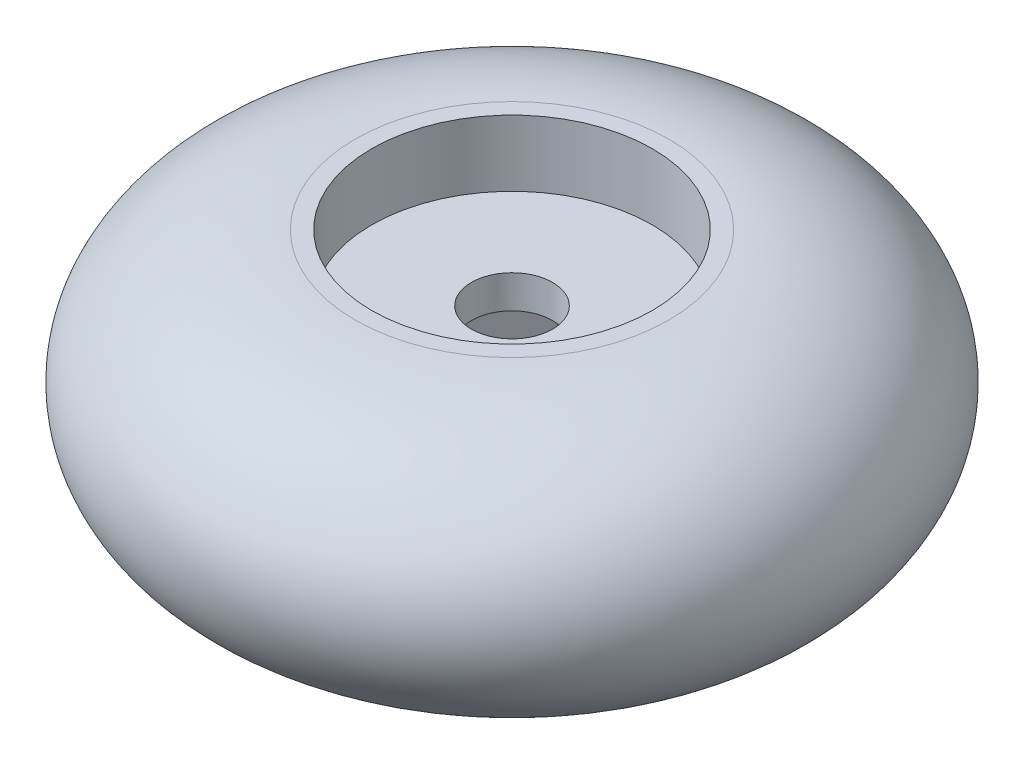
from build123d import *

# Parameters (mm, degrees)
SKETCH2_R                        = 8.5
CUT_EXTRUDE1_DEPTH               = 4
CUT_EXTRUDE2_DEPTH               = 10
F_10_0_1935_DIAMETER_HOLE1_D     = 4.9149
F_10_0_1935_DIAMETER_HOLE1_DEPTH = 5
F_10_0_1935_DIAMETER_HOLE1_TIP   = 1.476584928


with BuildPart() as part:
    # Sketch1 → Revolve1 (revolve)
    with BuildSketch(Plane.XY):
        with BuildLine():
            Line((9.5, 0), (0, 0))
            Line((0, 0), (0, -16))
            Line((0, -16), (9.5, -16))
            add(Edge.make_bspline(
                [(9.5, -16), (19.975475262, -16), (19.975475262, -8), (19.975475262, 0), (9.5, 0)],
                knots=[4.71238898, 4.71238898, 4.71238898, 6.283185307, 6.283185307, 7.853981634, 7.853981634, 7.853981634], degree=2, weights=[1, 0.707106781, 1, 0.707106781, 1]))
        make_face()
    revolve(axis=Axis((0, 0, 0), (0, -1, 0)))

    # Sketch2 → Cut-Extrude1 (cut)
    with BuildSketch(Plane(origin=(0, 0, 0), x_dir=(1, 0, 0), z_dir=(0, 1, 0))):
        with Locations(Location((0, 0, 0), (0, 0, 180))):
            Circle(SKETCH2_R)
    extrude(amount=-CUT_EXTRUDE1_DEPTH, mode=Mode.SUBTRACT)

    # Sketch4 → Cut-Extrude2 (cut)
    with BuildSketch(Plane(origin=(0, -16, 0), x_dir=(-1, 0, 0), z_dir=(0, -1, 0))):
        Polygon((-7.5, 0), (-3.75, -6.495190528), (3.75, -6.495190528), (7.5, 0), (3.75, 6.495190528), (-3.75, 6.495190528), align=None)
    extrude(amount=-CUT_EXTRUDE2_DEPTH, mode=Mode.SUBTRACT)

    # 10 _0.1935_ Diameter Hole1
    with Locations(Plane(origin=(0, -4, 0), x_dir=(1, 0, 0), z_dir=(0, 1, 0))):
        with Locations((0, 0)):
            Hole(F_10_0_1935_DIAMETER_HOLE1_D / 2, depth=F_10_0_1935_DIAMETER_HOLE1_DEPTH)
            with Locations((0, 0, -(F_10_0_1935_DIAMETER_HOLE1_DEPTH + F_10_0_1935_DIAMETER_HOLE1_TIP / 2))):  # 118° drill point
                Cone(0, F_10_0_1935_DIAMETER_HOLE1_D / 2, F_10_0_1935_DIAMETER_HOLE1_TIP, mode=Mode.SUBTRACT)


solid = part.part
